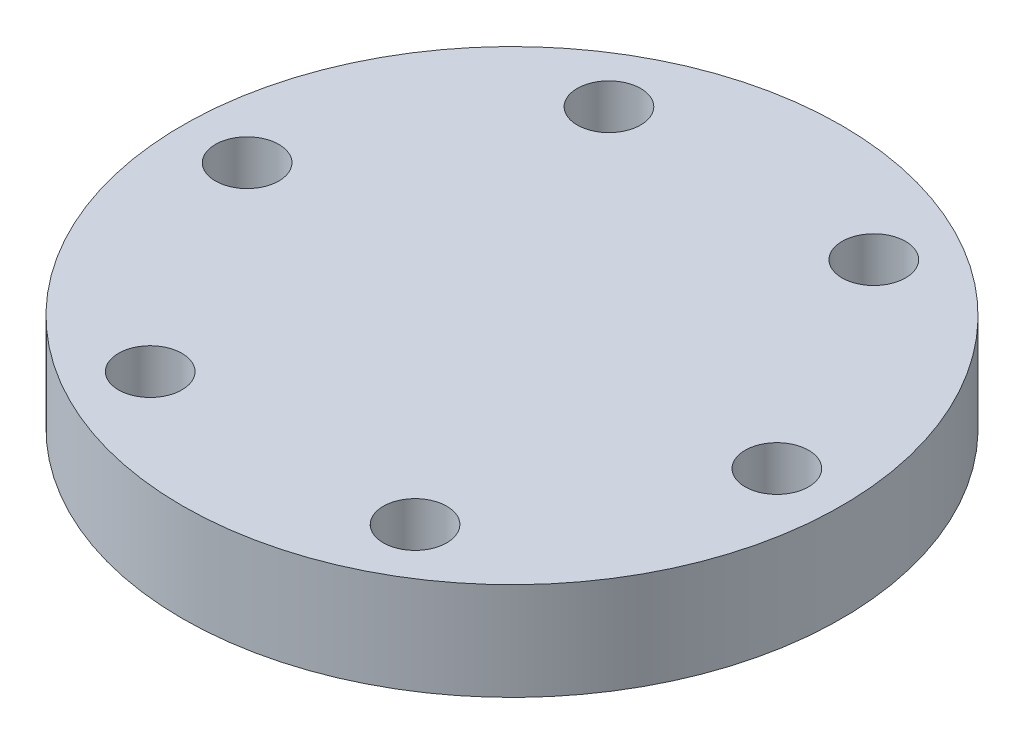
from build123d import *

# Parameters (mm, degrees)
SKETCH1_R           = 27
BOSS_EXTRUDE1_DEPTH = 8
SKETCH2_R           = 2.6
CUT_EXTRUDE1_DEPTH  = 40.012818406


with BuildPart() as part:
    # Sketch1 → Boss-Extrude1 (new body)
    with BuildSketch(Plane(origin=(0, 0, 0), x_dir=(1, 0, 0), z_dir=(0, 1, 0))):
        with Locations(Location((0, 0, 0), (0, 0, 270))):
            Circle(SKETCH1_R)
    extrude(amount=BOSS_EXTRUDE1_DEPTH)

    # Sketch2 → Cut-Extrude1 (cut, through all)
    with BuildSketch(Plane(origin=(0, 8, 0), x_dir=(1, 0, 0), z_dir=(0, 1, 0))):
        with Locations(Location((-21.7, 0, 0), (0, 0, 270))):
            Circle(SKETCH2_R)
        with Locations(Location((-10.85, 18.792751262, 0), (0, 0, 270))):
            Circle(SKETCH2_R)
        with Locations(Location((10.85, 18.792751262, 0), (0, 0, 270))):
            Circle(SKETCH2_R)
        with Locations(Location((21.7, 0, 0), (0, 0, 270))):
            Circle(SKETCH2_R)
        with Locations(Location((10.85, -18.792751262, 0), (0, 0, 270))):
            Circle(SKETCH2_R)
        with Locations(Location((-10.85, -18.792751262, 0), (0, 0, 270))):
            Circle(SKETCH2_R)
    extrude(amount=-CUT_EXTRUDE1_DEPTH, mode=Mode.SUBTRACT)


solid = part.part
